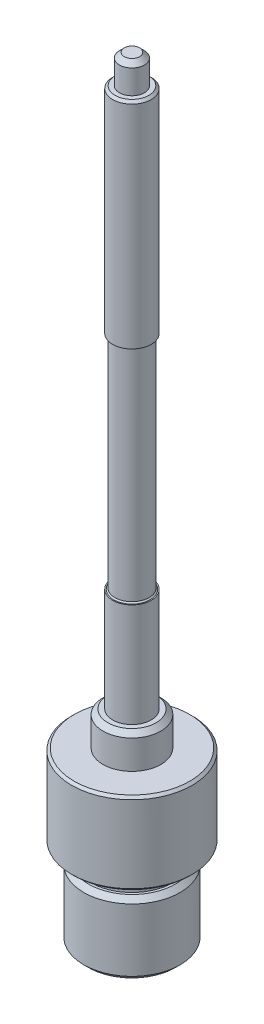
ISO-10303-21;
HEADER;
FILE_DESCRIPTION(('STEP AP214'),'2;1');
FILE_NAME('part.step','',(''),(''),'','','');
FILE_SCHEMA(('AUTOMOTIVE_DESIGN { 1 0 10303 214 1 1 1 1 }'));
ENDSEC;
DATA;
#1=APPLICATION_CONTEXT('core data for automotive mechanical design processes');
#2=APPLICATION_PROTOCOL_DEFINITION('international standard','automotive_design',2000,#1);
#3=PRODUCT_CONTEXT('',#1,'mechanical');
#4=PRODUCT('Part','Part','',(#3));
#5=PRODUCT_RELATED_PRODUCT_CATEGORY('part','',(#4));
#6=PRODUCT_DEFINITION_FORMATION('','',#4);
#7=PRODUCT_DEFINITION_CONTEXT('part definition',#1,'design');
#8=PRODUCT_DEFINITION('design','',#6,#7);
#9=PRODUCT_DEFINITION_SHAPE('','',#8);
#10=(LENGTH_UNIT() NAMED_UNIT(*) SI_UNIT(.MILLI.,.METRE.));
#11=(NAMED_UNIT(*) PLANE_ANGLE_UNIT() SI_UNIT($,.RADIAN.));
#12=(NAMED_UNIT(*) SI_UNIT($,.STERADIAN.) SOLID_ANGLE_UNIT());
#13=UNCERTAINTY_MEASURE_WITH_UNIT(LENGTH_MEASURE(1.E-05),#10,'distance_accuracy_value','');
#14=(GEOMETRIC_REPRESENTATION_CONTEXT(3) GLOBAL_UNCERTAINTY_ASSIGNED_CONTEXT((#13)) GLOBAL_UNIT_ASSIGNED_CONTEXT((#10,
#11,#12)) REPRESENTATION_CONTEXT('',''));
#15=CARTESIAN_POINT('',(0.,0.,0.));
#16=DIRECTION('',(0.,0.,1.));
#17=DIRECTION('',(1.,0.,0.));
#18=AXIS2_PLACEMENT_3D('',#15,#16,#17);
#19=CARTESIAN_POINT('',(0.,-47.5829905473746,6.9735185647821));
#20=DIRECTION('',(0.,-1.,0.));
#21=DIRECTION('',(0.,0.,-1.));
#22=AXIS2_PLACEMENT_3D('',#19,#20,#21);
#23=CONICAL_SURFACE('',#22,5.,1.03037682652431);
#24=CARTESIAN_POINT('',(0.,-44.5829905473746,6.9735185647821));
#25=VERTEX_POINT('',#24);
#26=VERTEX_LOOP('',#25);
#27=FACE_BOUND('',#26,.T.);
#28=CARTESIAN_POINT('',(0.,-47.5829905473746,6.9735185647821));
#29=DIRECTION('',(0.,1.,0.));
#30=DIRECTION('',(0.,0.,1.));
#31=AXIS2_PLACEMENT_3D('',#28,#29,#30);
#32=CIRCLE('',#31,5.);
#33=CARTESIAN_POINT('',(0.,-47.5829905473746,11.9735185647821));
#34=VERTEX_POINT('',#33);
#35=EDGE_CURVE('E47',#34,#34,#32,.T.);
#36=ORIENTED_EDGE('',*,*,#35,.F.);
#37=EDGE_LOOP('',(#36));
#38=FACE_BOUND('',#37,.T.);
#39=ADVANCED_FACE('F31',(#27,#38),#23,.F.);
#40=CARTESIAN_POINT('',(0.,85.4170094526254,6.97351856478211));
#41=DIRECTION('',(0.,1.,0.));
#42=DIRECTION('',(0.,0.,1.));
#43=AXIS2_PLACEMENT_3D('',#40,#41,#42);
#44=PLANE('',#43);
#45=CARTESIAN_POINT('',(0.,85.4170094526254,6.97351856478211));
#46=DIRECTION('',(0.,1.,0.));
#47=DIRECTION('',(0.,0.,1.));
#48=AXIS2_PLACEMENT_3D('',#45,#46,#47);
#49=CIRCLE('',#48,1.58640406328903);
#50=CARTESIAN_POINT('',(0.,85.4170094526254,8.55992262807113));
#51=VERTEX_POINT('',#50);
#52=EDGE_CURVE('E78',#51,#51,#49,.T.);
#53=ORIENTED_EDGE('',*,*,#52,.T.);
#54=EDGE_LOOP('',(#53));
#55=FACE_BOUND('',#54,.T.);
#56=ADVANCED_FACE('F43',(#55),#44,.T.);
#57=CARTESIAN_POINT('',(0.,85.4170094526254,6.97351856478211));
#58=DIRECTION('',(0.,1.,0.));
#59=DIRECTION('',(0.,0.,1.));
#60=AXIS2_PLACEMENT_3D('',#57,#58,#59);
#61=CYLINDRICAL_SURFACE('',#60,2.58640406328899);
#62=CARTESIAN_POINT('',(0.,84.4170094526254,6.97351856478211));
#63=DIRECTION('',(0.,1.,0.));
#64=DIRECTION('',(0.,0.,1.));
#65=AXIS2_PLACEMENT_3D('',#62,#63,#64);
#66=CIRCLE('',#65,2.58640406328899);
#67=CARTESIAN_POINT('',(0.,84.4170094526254,9.5599226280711));
#68=VERTEX_POINT('',#67);
#69=EDGE_CURVE('E81',#68,#68,#66,.F.);
#70=ORIENTED_EDGE('',*,*,#69,.T.);
#71=EDGE_LOOP('',(#70));
#72=FACE_BOUND('',#71,.T.);
#73=CARTESIAN_POINT('',(0.,79.4170094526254,6.97351856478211));
#74=DIRECTION('',(0.,1.,0.));
#75=DIRECTION('',(0.,0.,1.));
#76=AXIS2_PLACEMENT_3D('',#73,#74,#75);
#77=CIRCLE('',#76,2.58640406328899);
#78=CARTESIAN_POINT('',(0.,79.4170094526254,9.5599226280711));
#79=VERTEX_POINT('',#78);
#80=EDGE_CURVE('E75',#79,#79,#77,.T.);
#81=ORIENTED_EDGE('',*,*,#80,.T.);
#82=EDGE_LOOP('',(#81));
#83=FACE_BOUND('',#82,.T.);
#84=ADVANCED_FACE('F151',(#72,#83),#61,.T.);
#85=CARTESIAN_POINT('',(0.,79.4170094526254,10.9735185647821));
#86=DIRECTION('',(0.,1.,0.));
#87=DIRECTION('',(0.,0.,1.));
#88=AXIS2_PLACEMENT_3D('',#85,#86,#87);
#89=PLANE('',#88);
#90=CARTESIAN_POINT('',(0.,79.4170094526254,6.97351856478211));
#91=DIRECTION('',(0.,1.,0.));
#92=DIRECTION('',(0.,0.,1.));
#93=AXIS2_PLACEMENT_3D('',#90,#91,#92);
#94=CIRCLE('',#93,3.49999999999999);
#95=CARTESIAN_POINT('',(0.,79.4170094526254,10.4735185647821));
#96=VERTEX_POINT('',#95);
#97=EDGE_CURVE('E102',#96,#96,#94,.T.);
#98=ORIENTED_EDGE('',*,*,#97,.T.);
#99=EDGE_LOOP('',(#98));
#100=FACE_BOUND('',#99,.T.);
#101=ORIENTED_EDGE('',*,*,#80,.F.);
#102=EDGE_LOOP('',(#101));
#103=FACE_BOUND('',#102,.T.);
#104=ADVANCED_FACE('F145',(#100,#103),#89,.T.);
#105=CARTESIAN_POINT('',(0.,85.4170094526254,6.97351856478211));
#106=DIRECTION('',(0.,1.,0.));
#107=DIRECTION('',(0.,0.,1.));
#108=AXIS2_PLACEMENT_3D('',#105,#106,#107);
#109=CYLINDRICAL_SURFACE('',#108,4.);
#110=CARTESIAN_POINT('',(0.,78.9170094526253,6.97351856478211));
#111=DIRECTION('',(0.,1.,0.));
#112=DIRECTION('',(0.,0.,1.));
#113=AXIS2_PLACEMENT_3D('',#110,#111,#112);
#114=CIRCLE('',#113,4.);
#115=CARTESIAN_POINT('',(0.,78.9170094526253,10.9735185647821));
#116=VERTEX_POINT('',#115);
#117=EDGE_CURVE('E105',#116,#116,#114,.F.);
#118=ORIENTED_EDGE('',*,*,#117,.T.);
#119=EDGE_LOOP('',(#118));
#120=FACE_BOUND('',#119,.T.);
#121=CARTESIAN_POINT('',(0.,34.9170094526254,6.9735185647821));
#122=DIRECTION('',(0.,1.,0.));
#123=DIRECTION('',(0.,0.,1.));
#124=AXIS2_PLACEMENT_3D('',#121,#122,#123);
#125=CIRCLE('',#124,4.);
#126=CARTESIAN_POINT('',(0.,34.9170094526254,10.9735185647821));
#127=VERTEX_POINT('',#126);
#128=EDGE_CURVE('E72',#127,#127,#125,.T.);
#129=ORIENTED_EDGE('',*,*,#128,.T.);
#130=EDGE_LOOP('',(#129));
#131=FACE_BOUND('',#130,.T.);
#132=ADVANCED_FACE('F140',(#120,#131),#109,.T.);
#133=CARTESIAN_POINT('',(0.,34.9170094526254,10.502774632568));
#134=DIRECTION('',(0.,-1.,0.));
#135=DIRECTION('',(0.,0.,-1.));
#136=AXIS2_PLACEMENT_3D('',#133,#134,#135);
#137=PLANE('',#136);
#138=CARTESIAN_POINT('',(0.,34.9170094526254,6.9735185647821));
#139=DIRECTION('',(0.,-1.,0.));
#140=DIRECTION('',(0.,0.,-1.));
#141=AXIS2_PLACEMENT_3D('',#138,#139,#140);
#142=CIRCLE('',#141,3.77925606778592);
#143=CARTESIAN_POINT('',(0.,34.9170094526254,3.19426249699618));
#144=VERTEX_POINT('',#143);
#145=EDGE_CURVE('E120',#144,#144,#142,.F.);
#146=ORIENTED_EDGE('',*,*,#145,.T.);
#147=EDGE_LOOP('',(#146));
#148=FACE_BOUND('',#147,.T.);
#149=ORIENTED_EDGE('',*,*,#128,.F.);
#150=EDGE_LOOP('',(#149));
#151=FACE_BOUND('',#150,.T.);
#152=ADVANCED_FACE('F137',(#148,#151),#137,.T.);
#153=CARTESIAN_POINT('',(0.,85.4170094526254,6.97351856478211));
#154=DIRECTION('',(0.,1.,0.));
#155=DIRECTION('',(0.,0.,1.));
#156=AXIS2_PLACEMENT_3D('',#153,#154,#155);
#157=CYLINDRICAL_SURFACE('',#156,3.52925606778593);
#158=CARTESIAN_POINT('',(0.,34.6670094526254,6.9735185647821));
#159=DIRECTION('',(0.,-1.,0.));
#160=DIRECTION('',(0.,0.,-1.));
#161=AXIS2_PLACEMENT_3D('',#158,#159,#160);
#162=CIRCLE('',#161,3.52925606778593);
#163=CARTESIAN_POINT('',(0.,34.6670094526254,3.44426249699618));
#164=VERTEX_POINT('',#163);
#165=EDGE_CURVE('E38',#164,#164,#162,.T.);
#166=ORIENTED_EDGE('',*,*,#165,.T.);
#167=EDGE_LOOP('',(#166));
#168=FACE_BOUND('',#167,.T.);
#169=CARTESIAN_POINT('',(0.,-10.8329905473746,6.9735185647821));
#170=DIRECTION('',(0.,1.,0.));
#171=DIRECTION('',(0.,0.,1.));
#172=AXIS2_PLACEMENT_3D('',#169,#170,#171);
#173=CIRCLE('',#172,3.52925606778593);
#174=CARTESIAN_POINT('',(0.,-10.8329905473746,10.502774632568));
#175=VERTEX_POINT('',#174);
#176=EDGE_CURVE('E123',#175,#175,#173,.T.);
#177=ORIENTED_EDGE('',*,*,#176,.T.);
#178=EDGE_LOOP('',(#177));
#179=FACE_BOUND('',#178,.T.);
#180=ADVANCED_FACE('F128',(#168,#179),#157,.T.);
#181=CARTESIAN_POINT('',(0.,-11.0829905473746,10.9735185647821));
#182=DIRECTION('',(0.,1.,0.));
#183=DIRECTION('',(0.,0.,1.));
#184=AXIS2_PLACEMENT_3D('',#181,#182,#183);
#185=PLANE('',#184);
#186=CARTESIAN_POINT('',(0.,-11.0829905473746,6.9735185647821));
#187=DIRECTION('',(0.,1.,0.));
#188=DIRECTION('',(0.,0.,1.));
#189=AXIS2_PLACEMENT_3D('',#186,#187,#188);
#190=CIRCLE('',#189,3.77925606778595);
#191=CARTESIAN_POINT('',(0.,-11.0829905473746,10.7527746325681));
#192=VERTEX_POINT('',#191);
#193=EDGE_CURVE('E11',#192,#192,#190,.F.);
#194=ORIENTED_EDGE('',*,*,#193,.T.);
#195=EDGE_LOOP('',(#194));
#196=FACE_BOUND('',#195,.T.);
#197=CARTESIAN_POINT('',(0.,-11.0829905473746,6.9735185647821));
#198=DIRECTION('',(0.,1.,0.));
#199=DIRECTION('',(0.,0.,1.));
#200=AXIS2_PLACEMENT_3D('',#197,#198,#199);
#201=CIRCLE('',#200,4.);
#202=CARTESIAN_POINT('',(0.,-11.0829905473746,10.9735185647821));
#203=VERTEX_POINT('',#202);
#204=EDGE_CURVE('E69',#203,#203,#201,.T.);
#205=ORIENTED_EDGE('',*,*,#204,.T.);
#206=EDGE_LOOP('',(#205));
#207=FACE_BOUND('',#206,.T.);
#208=ADVANCED_FACE('F223',(#196,#207),#185,.T.);
#209=CARTESIAN_POINT('',(0.,85.4170094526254,6.97351856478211));
#210=DIRECTION('',(0.,1.,0.));
#211=DIRECTION('',(0.,0.,1.));
#212=AXIS2_PLACEMENT_3D('',#209,#210,#211);
#213=CYLINDRICAL_SURFACE('',#212,4.);
#214=CARTESIAN_POINT('',(0.,-32.5829905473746,6.9735185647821));
#215=DIRECTION('',(0.,1.,0.));
#216=DIRECTION('',(0.,0.,1.));
#217=AXIS2_PLACEMENT_3D('',#214,#215,#216);
#218=CIRCLE('',#217,4.);
#219=CARTESIAN_POINT('',(0.,-32.5829905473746,10.9735185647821));
#220=VERTEX_POINT('',#219);
#221=EDGE_CURVE('E66',#220,#220,#218,.T.);
#222=ORIENTED_EDGE('',*,*,#221,.T.);
#223=EDGE_LOOP('',(#222));
#224=FACE_BOUND('',#223,.T.);
#225=ORIENTED_EDGE('',*,*,#204,.F.);
#226=EDGE_LOOP('',(#225));
#227=FACE_BOUND('',#226,.T.);
#228=ADVANCED_FACE('F219',(#224,#227),#213,.T.);
#229=CARTESIAN_POINT('',(0.,-32.5829905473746,12.9735185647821));
#230=DIRECTION('',(0.,1.,0.));
#231=DIRECTION('',(0.,0.,1.));
#232=AXIS2_PLACEMENT_3D('',#229,#230,#231);
#233=PLANE('',#232);
#234=CARTESIAN_POINT('',(0.,-32.5829905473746,6.9735185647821));
#235=DIRECTION('',(0.,1.,0.));
#236=DIRECTION('',(0.,0.,1.));
#237=AXIS2_PLACEMENT_3D('',#234,#235,#236);
#238=CIRCLE('',#237,4.99999999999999);
#239=CARTESIAN_POINT('',(0.,-32.5829905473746,11.9735185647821));
#240=VERTEX_POINT('',#239);
#241=EDGE_CURVE('E84',#240,#240,#238,.T.);
#242=ORIENTED_EDGE('',*,*,#241,.T.);
#243=EDGE_LOOP('',(#242));
#244=FACE_BOUND('',#243,.T.);
#245=ORIENTED_EDGE('',*,*,#221,.F.);
#246=EDGE_LOOP('',(#245));
#247=FACE_BOUND('',#246,.T.);
#248=ADVANCED_FACE('F215',(#244,#247),#233,.T.);
#249=CARTESIAN_POINT('',(0.,85.4170094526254,6.97351856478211));
#250=DIRECTION('',(0.,1.,0.));
#251=DIRECTION('',(0.,0.,1.));
#252=AXIS2_PLACEMENT_3D('',#249,#250,#251);
#253=CYLINDRICAL_SURFACE('',#252,6.);
#254=CARTESIAN_POINT('',(0.,-33.5829905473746,6.9735185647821));
#255=DIRECTION('',(0.,1.,0.));
#256=DIRECTION('',(0.,0.,1.));
#257=AXIS2_PLACEMENT_3D('',#254,#255,#256);
#258=CIRCLE('',#257,6.);
#259=CARTESIAN_POINT('',(0.,-33.5829905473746,12.9735185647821));
#260=VERTEX_POINT('',#259);
#261=EDGE_CURVE('E87',#260,#260,#258,.F.);
#262=ORIENTED_EDGE('',*,*,#261,.T.);
#263=EDGE_LOOP('',(#262));
#264=FACE_BOUND('',#263,.T.);
#265=CARTESIAN_POINT('',(0.,-39.5829905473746,6.9735185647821));
#266=DIRECTION('',(0.,1.,0.));
#267=DIRECTION('',(0.,0.,1.));
#268=AXIS2_PLACEMENT_3D('',#265,#266,#267);
#269=CIRCLE('',#268,6.);
#270=CARTESIAN_POINT('',(0.,-39.5829905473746,12.9735185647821));
#271=VERTEX_POINT('',#270);
#272=EDGE_CURVE('E63',#271,#271,#269,.T.);
#273=ORIENTED_EDGE('',*,*,#272,.T.);
#274=EDGE_LOOP('',(#273));
#275=FACE_BOUND('',#274,.T.);
#276=ADVANCED_FACE('F208',(#264,#275),#253,.T.);
#277=CARTESIAN_POINT('',(0.,-39.5829905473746,12.9735185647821));
#278=DIRECTION('',(0.,1.,0.));
#279=DIRECTION('',(0.,0.,1.));
#280=AXIS2_PLACEMENT_3D('',#277,#278,#279);
#281=PLANE('',#280);
#282=CARTESIAN_POINT('',(0.,-39.5829905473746,6.9735185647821));
#283=DIRECTION('',(0.,1.,0.));
#284=DIRECTION('',(0.,0.,1.));
#285=AXIS2_PLACEMENT_3D('',#282,#283,#284);
#286=CIRCLE('',#285,12.);
#287=CARTESIAN_POINT('',(0.,-39.5829905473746,18.9735185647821));
#288=VERTEX_POINT('',#287);
#289=EDGE_CURVE('E108',#288,#288,#286,.T.);
#290=ORIENTED_EDGE('',*,*,#289,.T.);
#291=EDGE_LOOP('',(#290));
#292=FACE_BOUND('',#291,.T.);
#293=ORIENTED_EDGE('',*,*,#272,.F.);
#294=EDGE_LOOP('',(#293));
#295=FACE_BOUND('',#294,.T.);
#296=ADVANCED_FACE('F198',(#292,#295),#281,.T.);
#297=CARTESIAN_POINT('',(0.,85.4170094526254,6.97351856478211));
#298=DIRECTION('',(0.,1.,0.));
#299=DIRECTION('',(0.,0.,1.));
#300=AXIS2_PLACEMENT_3D('',#297,#298,#299);
#301=CYLINDRICAL_SURFACE('',#300,12.5);
#302=CARTESIAN_POINT('',(0.,-40.0829905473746,6.9735185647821));
#303=DIRECTION('',(0.,1.,0.));
#304=DIRECTION('',(0.,0.,1.));
#305=AXIS2_PLACEMENT_3D('',#302,#303,#304);
#306=CIRCLE('',#305,12.5);
#307=CARTESIAN_POINT('',(0.,-40.0829905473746,19.4735185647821));
#308=VERTEX_POINT('',#307);
#309=EDGE_CURVE('E114',#308,#308,#306,.F.);
#310=ORIENTED_EDGE('',*,*,#309,.T.);
#311=EDGE_LOOP('',(#310));
#312=FACE_BOUND('',#311,.T.);
#313=CARTESIAN_POINT('',(0.,-56.0829905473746,6.9735185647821));
#314=DIRECTION('',(0.,-1.,0.));
#315=DIRECTION('',(0.,0.,-1.));
#316=AXIS2_PLACEMENT_3D('',#313,#314,#315);
#317=CIRCLE('',#316,12.5);
#318=CARTESIAN_POINT('',(0.,-56.0829905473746,-5.5264814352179));
#319=VERTEX_POINT('',#318);
#320=EDGE_CURVE('E111',#319,#319,#317,.F.);
#321=ORIENTED_EDGE('',*,*,#320,.T.);
#322=EDGE_LOOP('',(#321));
#323=FACE_BOUND('',#322,.T.);
#324=ADVANCED_FACE('F195',(#312,#323),#301,.T.);
#325=CARTESIAN_POINT('',(0.,-56.5829905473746,19.4735185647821));
#326=DIRECTION('',(0.,-1.,0.));
#327=DIRECTION('',(0.,0.,-1.));
#328=AXIS2_PLACEMENT_3D('',#325,#326,#327);
#329=PLANE('',#328);
#330=CARTESIAN_POINT('',(0.,-56.5829905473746,6.9735185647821));
#331=DIRECTION('',(0.,-1.,0.));
#332=DIRECTION('',(0.,0.,-1.));
#333=AXIS2_PLACEMENT_3D('',#330,#331,#332);
#334=CIRCLE('',#333,12.);
#335=CARTESIAN_POINT('',(0.,-56.5829905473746,-5.02648143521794));
#336=VERTEX_POINT('',#335);
#337=EDGE_CURVE('E117',#336,#336,#334,.T.);
#338=ORIENTED_EDGE('',*,*,#337,.T.);
#339=EDGE_LOOP('',(#338));
#340=FACE_BOUND('',#339,.T.);
#341=CARTESIAN_POINT('',(0.,-56.5829905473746,6.9735185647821));
#342=DIRECTION('',(0.,1.,0.));
#343=DIRECTION('',(0.,0.,1.));
#344=AXIS2_PLACEMENT_3D('',#341,#342,#343);
#345=CIRCLE('',#344,8.5);
#346=CARTESIAN_POINT('',(0.,-56.5829905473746,15.4735185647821));
#347=VERTEX_POINT('',#346);
#348=EDGE_CURVE('E60',#347,#347,#345,.T.);
#349=ORIENTED_EDGE('',*,*,#348,.T.);
#350=EDGE_LOOP('',(#349));
#351=FACE_BOUND('',#350,.T.);
#352=ADVANCED_FACE('F197',(#340,#351),#329,.T.);
#353=CARTESIAN_POINT('',(0.,85.4170094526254,6.97351856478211));
#354=DIRECTION('',(0.,1.,0.));
#355=DIRECTION('',(0.,0.,1.));
#356=AXIS2_PLACEMENT_3D('',#353,#354,#355);
#357=CYLINDRICAL_SURFACE('',#356,8.5);
#358=CARTESIAN_POINT('',(0.,-59.5829905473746,6.97351856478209));
#359=DIRECTION('',(0.,1.,0.));
#360=DIRECTION('',(0.,0.,1.));
#361=AXIS2_PLACEMENT_3D('',#358,#359,#360);
#362=CIRCLE('',#361,8.5);
#363=CARTESIAN_POINT('',(0.,-59.5829905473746,15.4735185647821));
#364=VERTEX_POINT('',#363);
#365=EDGE_CURVE('E57',#364,#364,#362,.T.);
#366=ORIENTED_EDGE('',*,*,#365,.T.);
#367=EDGE_LOOP('',(#366));
#368=FACE_BOUND('',#367,.T.);
#369=ORIENTED_EDGE('',*,*,#348,.F.);
#370=EDGE_LOOP('',(#369));
#371=FACE_BOUND('',#370,.T.);
#372=ADVANCED_FACE('F205',(#368,#371),#357,.T.);
#373=CARTESIAN_POINT('',(0.,-59.5829905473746,15.4735185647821));
#374=DIRECTION('',(0.,1.,0.));
#375=DIRECTION('',(0.,0.,1.));
#376=AXIS2_PLACEMENT_3D('',#373,#374,#375);
#377=PLANE('',#376);
#378=CARTESIAN_POINT('',(0.,-59.5829905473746,6.97351856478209));
#379=DIRECTION('',(0.,1.,0.));
#380=DIRECTION('',(0.,0.,1.));
#381=AXIS2_PLACEMENT_3D('',#378,#379,#380);
#382=CIRCLE('',#381,9.00000000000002);
#383=CARTESIAN_POINT('',(0.,-59.5829905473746,15.9735185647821));
#384=VERTEX_POINT('',#383);
#385=EDGE_CURVE('E90',#384,#384,#382,.T.);
#386=ORIENTED_EDGE('',*,*,#385,.T.);
#387=EDGE_LOOP('',(#386));
#388=FACE_BOUND('',#387,.T.);
#389=ORIENTED_EDGE('',*,*,#365,.F.);
#390=EDGE_LOOP('',(#389));
#391=FACE_BOUND('',#390,.T.);
#392=ADVANCED_FACE('F355',(#388,#391),#377,.T.);
#393=CARTESIAN_POINT('',(0.,85.4170094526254,6.97351856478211));
#394=DIRECTION('',(0.,1.,0.));
#395=DIRECTION('',(0.,0.,1.));
#396=AXIS2_PLACEMENT_3D('',#393,#394,#395);
#397=CYLINDRICAL_SURFACE('',#396,10.);
#398=CARTESIAN_POINT('',(0.,-60.5829905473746,6.97351856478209));
#399=DIRECTION('',(0.,1.,0.));
#400=DIRECTION('',(0.,0.,1.));
#401=AXIS2_PLACEMENT_3D('',#398,#399,#400);
#402=CIRCLE('',#401,10.);
#403=CARTESIAN_POINT('',(0.,-60.5829905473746,16.9735185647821));
#404=VERTEX_POINT('',#403);
#405=EDGE_CURVE('E96',#404,#404,#402,.F.);
#406=ORIENTED_EDGE('',*,*,#405,.T.);
#407=EDGE_LOOP('',(#406));
#408=FACE_BOUND('',#407,.T.);
#409=CARTESIAN_POINT('',(0.,-73.5829905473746,6.97351856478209));
#410=DIRECTION('',(0.,-1.,0.));
#411=DIRECTION('',(0.,0.,-1.));
#412=AXIS2_PLACEMENT_3D('',#409,#410,#411);
#413=CIRCLE('',#412,10.);
#414=CARTESIAN_POINT('',(0.,-73.5829905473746,-3.0264814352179));
#415=VERTEX_POINT('',#414);
#416=EDGE_CURVE('E93',#415,#415,#413,.F.);
#417=ORIENTED_EDGE('',*,*,#416,.T.);
#418=EDGE_LOOP('',(#417));
#419=FACE_BOUND('',#418,.T.);
#420=ADVANCED_FACE('F364',(#408,#419),#397,.T.);
#421=CARTESIAN_POINT('',(0.,-74.5829905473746,16.9735185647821));
#422=DIRECTION('',(0.,-1.,0.));
#423=DIRECTION('',(0.,0.,-1.));
#424=AXIS2_PLACEMENT_3D('',#421,#422,#423);
#425=PLANE('',#424);
#426=CARTESIAN_POINT('',(0.,-74.5829905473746,6.97351856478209));
#427=DIRECTION('',(0.,-1.,0.));
#428=DIRECTION('',(0.,0.,-1.));
#429=AXIS2_PLACEMENT_3D('',#426,#427,#428);
#430=CIRCLE('',#429,8.99999999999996);
#431=CARTESIAN_POINT('',(0.,-74.5829905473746,-2.02648143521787));
#432=VERTEX_POINT('',#431);
#433=EDGE_CURVE('E99',#432,#432,#430,.T.);
#434=ORIENTED_EDGE('',*,*,#433,.T.);
#435=EDGE_LOOP('',(#434));
#436=FACE_BOUND('',#435,.T.);
#437=CARTESIAN_POINT('',(0.,-74.5829905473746,6.97351856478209));
#438=DIRECTION('',(0.,1.,0.));
#439=DIRECTION('',(0.,0.,1.));
#440=AXIS2_PLACEMENT_3D('',#437,#438,#439);
#441=CIRCLE('',#440,7.99999999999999);
#442=CARTESIAN_POINT('',(0.,-74.5829905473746,14.9735185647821));
#443=VERTEX_POINT('',#442);
#444=EDGE_CURVE('E52',#443,#443,#441,.T.);
#445=ORIENTED_EDGE('',*,*,#444,.T.);
#446=EDGE_LOOP('',(#445));
#447=FACE_BOUND('',#446,.T.);
#448=ADVANCED_FACE('F346',(#436,#447),#425,.T.);
#449=CARTESIAN_POINT('',(0.,-74.5829905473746,6.97351856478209));
#450=DIRECTION('',(0.,-1.,0.));
#451=DIRECTION('',(0.,0.,-1.));
#452=AXIS2_PLACEMENT_3D('',#449,#450,#451);
#453=CONICAL_SURFACE('',#452,8.,0.211093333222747);
#454=CARTESIAN_POINT('',(0.,-60.5829905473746,6.97351856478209));
#455=DIRECTION('',(0.,1.,0.));
#456=DIRECTION('',(0.,0.,1.));
#457=AXIS2_PLACEMENT_3D('',#454,#455,#456);
#458=CIRCLE('',#457,5.);
#459=CARTESIAN_POINT('',(0.,-60.5829905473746,11.9735185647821));
#460=VERTEX_POINT('',#459);
#461=EDGE_CURVE('E49',#460,#460,#458,.T.);
#462=ORIENTED_EDGE('',*,*,#461,.T.);
#463=EDGE_LOOP('',(#462));
#464=FACE_BOUND('',#463,.T.);
#465=ORIENTED_EDGE('',*,*,#444,.F.);
#466=EDGE_LOOP('',(#465));
#467=FACE_BOUND('',#466,.T.);
#468=ADVANCED_FACE('F337',(#464,#467),#453,.F.);
#469=CARTESIAN_POINT('',(0.,85.4170094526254,6.97351856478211));
#470=DIRECTION('',(0.,1.,0.));
#471=DIRECTION('',(0.,0.,1.));
#472=AXIS2_PLACEMENT_3D('',#469,#470,#471);
#473=CYLINDRICAL_SURFACE('',#472,5.);
#474=ORIENTED_EDGE('',*,*,#35,.T.);
#475=EDGE_LOOP('',(#474));
#476=FACE_BOUND('',#475,.T.);
#477=ORIENTED_EDGE('',*,*,#461,.F.);
#478=EDGE_LOOP('',(#477));
#479=FACE_BOUND('',#478,.T.);
#480=ADVANCED_FACE('F166',(#476,#479),#473,.F.);
#481=CARTESIAN_POINT('',(0.,85.4170094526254,6.97351856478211));
#482=DIRECTION('',(0.,-1.,0.));
#483=DIRECTION('',(0.,0.,-1.));
#484=AXIS2_PLACEMENT_3D('',#481,#482,#483);
#485=CONICAL_SURFACE('',#484,1.58640406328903,0.785398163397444);
#486=ORIENTED_EDGE('',*,*,#69,.F.);
#487=EDGE_LOOP('',(#486));
#488=FACE_BOUND('',#487,.T.);
#489=ORIENTED_EDGE('',*,*,#52,.F.);
#490=EDGE_LOOP('',(#489));
#491=FACE_BOUND('',#490,.T.);
#492=ADVANCED_FACE('F162',(#488,#491),#485,.T.);
#493=CARTESIAN_POINT('',(0.,-32.5829905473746,6.9735185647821));
#494=DIRECTION('',(0.,-1.,0.));
#495=DIRECTION('',(0.,0.,-1.));
#496=AXIS2_PLACEMENT_3D('',#493,#494,#495);
#497=CONICAL_SURFACE('',#496,4.99999999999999,0.785398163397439);
#498=ORIENTED_EDGE('',*,*,#261,.F.);
#499=EDGE_LOOP('',(#498));
#500=FACE_BOUND('',#499,.T.);
#501=ORIENTED_EDGE('',*,*,#241,.F.);
#502=EDGE_LOOP('',(#501));
#503=FACE_BOUND('',#502,.T.);
#504=ADVANCED_FACE('F165',(#500,#503),#497,.T.);
#505=CARTESIAN_POINT('',(0.,-59.5829905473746,6.97351856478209));
#506=DIRECTION('',(0.,-1.,0.));
#507=DIRECTION('',(0.,0.,-1.));
#508=AXIS2_PLACEMENT_3D('',#505,#506,#507);
#509=CONICAL_SURFACE('',#508,9.00000000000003,0.785398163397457);
#510=ORIENTED_EDGE('',*,*,#405,.F.);
#511=EDGE_LOOP('',(#510));
#512=FACE_BOUND('',#511,.T.);
#513=ORIENTED_EDGE('',*,*,#385,.F.);
#514=EDGE_LOOP('',(#513));
#515=FACE_BOUND('',#514,.T.);
#516=ADVANCED_FACE('F170',(#512,#515),#509,.T.);
#517=CARTESIAN_POINT('',(0.,-73.5829905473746,6.97351856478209));
#518=DIRECTION('',(0.,1.,0.));
#519=DIRECTION('',(0.,0.,1.));
#520=AXIS2_PLACEMENT_3D('',#517,#518,#519);
#521=CONICAL_SURFACE('',#520,10.,0.78539816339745);
#522=ORIENTED_EDGE('',*,*,#433,.F.);
#523=EDGE_LOOP('',(#522));
#524=FACE_BOUND('',#523,.T.);
#525=ORIENTED_EDGE('',*,*,#416,.F.);
#526=EDGE_LOOP('',(#525));
#527=FACE_BOUND('',#526,.T.);
#528=ADVANCED_FACE('F174',(#524,#527),#521,.T.);
#529=CARTESIAN_POINT('',(0.,79.4170094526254,6.97351856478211));
#530=DIRECTION('',(0.,-1.,0.));
#531=DIRECTION('',(0.,0.,-1.));
#532=AXIS2_PLACEMENT_3D('',#529,#530,#531);
#533=CONICAL_SURFACE('',#532,3.49999999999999,0.785398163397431);
#534=ORIENTED_EDGE('',*,*,#117,.F.);
#535=EDGE_LOOP('',(#534));
#536=FACE_BOUND('',#535,.T.);
#537=ORIENTED_EDGE('',*,*,#97,.F.);
#538=EDGE_LOOP('',(#537));
#539=FACE_BOUND('',#538,.T.);
#540=ADVANCED_FACE('F178',(#536,#539),#533,.T.);
#541=CARTESIAN_POINT('',(0.,-39.5829905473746,6.9735185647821));
#542=DIRECTION('',(0.,-1.,0.));
#543=DIRECTION('',(0.,0.,-1.));
#544=AXIS2_PLACEMENT_3D('',#541,#542,#543);
#545=CONICAL_SURFACE('',#544,12.,0.785398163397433);
#546=ORIENTED_EDGE('',*,*,#309,.F.);
#547=EDGE_LOOP('',(#546));
#548=FACE_BOUND('',#547,.T.);
#549=ORIENTED_EDGE('',*,*,#289,.F.);
#550=EDGE_LOOP('',(#549));
#551=FACE_BOUND('',#550,.T.);
#552=ADVANCED_FACE('F182',(#548,#551),#545,.T.);
#553=CARTESIAN_POINT('',(0.,-56.0829905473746,6.9735185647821));
#554=DIRECTION('',(0.,1.,0.));
#555=DIRECTION('',(0.,0.,1.));
#556=AXIS2_PLACEMENT_3D('',#553,#554,#555);
#557=CONICAL_SURFACE('',#556,12.5,0.785398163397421);
#558=ORIENTED_EDGE('',*,*,#337,.F.);
#559=EDGE_LOOP('',(#558));
#560=FACE_BOUND('',#559,.T.);
#561=ORIENTED_EDGE('',*,*,#320,.F.);
#562=EDGE_LOOP('',(#561));
#563=FACE_BOUND('',#562,.T.);
#564=ADVANCED_FACE('F134',(#560,#563),#557,.T.);
#565=CARTESIAN_POINT('',(0.,34.9170094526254,6.9735185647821));
#566=DIRECTION('',(0.,1.,0.));
#567=DIRECTION('',(0.,0.,1.));
#568=AXIS2_PLACEMENT_3D('',#565,#566,#567);
#569=CONICAL_SURFACE('',#568,3.77925606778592,0.785398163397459);
#570=ORIENTED_EDGE('',*,*,#165,.F.);
#571=EDGE_LOOP('',(#570));
#572=FACE_BOUND('',#571,.T.);
#573=ORIENTED_EDGE('',*,*,#145,.F.);
#574=EDGE_LOOP('',(#573));
#575=FACE_BOUND('',#574,.T.);
#576=ADVANCED_FACE('F131',(#572,#575),#569,.T.);
#577=CARTESIAN_POINT('',(0.,-10.8329905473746,6.9735185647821));
#578=DIRECTION('',(0.,-1.,0.));
#579=DIRECTION('',(0.,0.,-1.));
#580=AXIS2_PLACEMENT_3D('',#577,#578,#579);
#581=CONICAL_SURFACE('',#580,3.52925606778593,0.785398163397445);
#582=ORIENTED_EDGE('',*,*,#193,.F.);
#583=EDGE_LOOP('',(#582));
#584=FACE_BOUND('',#583,.T.);
#585=ORIENTED_EDGE('',*,*,#176,.F.);
#586=EDGE_LOOP('',(#585));
#587=FACE_BOUND('',#586,.T.);
#588=ADVANCED_FACE('F33',(#584,#587),#581,.T.);
#589=CLOSED_SHELL('',(#39,#56,#84,#104,#132,#152,#180,#208,#228,#248,#276,#296,#324,#352,#372,
#392,#420,#448,#468,#480,#492,#504,#516,#528,#540,#552,#564,#576,#588));
#590=MANIFOLD_SOLID_BREP('B2',#589);
#591=ADVANCED_BREP_SHAPE_REPRESENTATION('',(#18,#590),#14);
#592=SHAPE_DEFINITION_REPRESENTATION(#9,#591);
ENDSEC;
END-ISO-10303-21;
